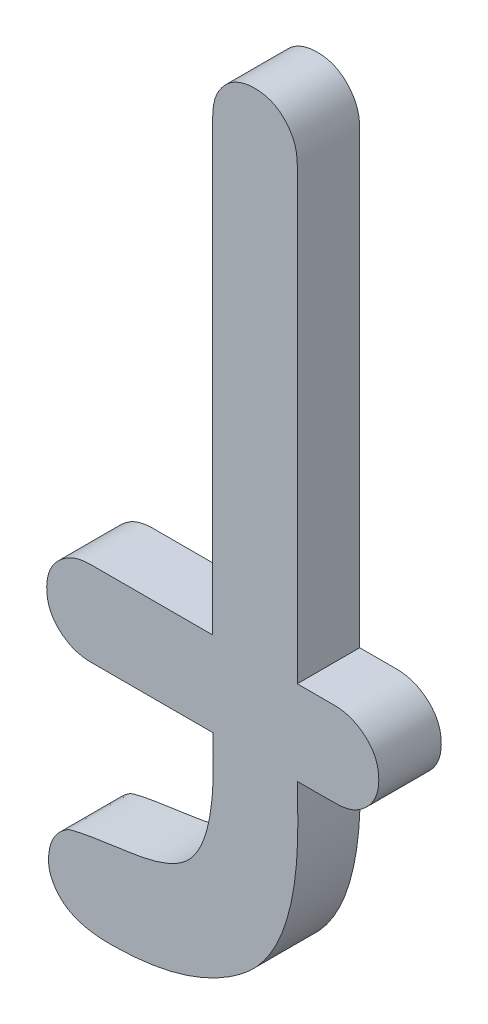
ISO-10303-21;
HEADER;
FILE_DESCRIPTION(('STEP AP214'),'2;1');
FILE_NAME('part.step','',(''),(''),'','','');
FILE_SCHEMA(('AUTOMOTIVE_DESIGN { 1 0 10303 214 1 1 1 1 }'));
ENDSEC;
DATA;
#1=APPLICATION_CONTEXT('core data for automotive mechanical design processes');
#2=APPLICATION_PROTOCOL_DEFINITION('international standard','automotive_design',2000,#1);
#3=PRODUCT_CONTEXT('',#1,'mechanical');
#4=PRODUCT('Part','Part','',(#3));
#5=PRODUCT_RELATED_PRODUCT_CATEGORY('part','',(#4));
#6=PRODUCT_DEFINITION_FORMATION('','',#4);
#7=PRODUCT_DEFINITION_CONTEXT('part definition',#1,'design');
#8=PRODUCT_DEFINITION('design','',#6,#7);
#9=PRODUCT_DEFINITION_SHAPE('','',#8);
#10=(LENGTH_UNIT() NAMED_UNIT(*) SI_UNIT(.MILLI.,.METRE.));
#11=(NAMED_UNIT(*) PLANE_ANGLE_UNIT() SI_UNIT($,.RADIAN.));
#12=(NAMED_UNIT(*) SI_UNIT($,.STERADIAN.) SOLID_ANGLE_UNIT());
#13=UNCERTAINTY_MEASURE_WITH_UNIT(LENGTH_MEASURE(1.E-05),#10,'distance_accuracy_value','');
#14=(GEOMETRIC_REPRESENTATION_CONTEXT(3) GLOBAL_UNCERTAINTY_ASSIGNED_CONTEXT((#13)) GLOBAL_UNIT_ASSIGNED_CONTEXT((#10,
#11,#12)) REPRESENTATION_CONTEXT('',''));
#15=CARTESIAN_POINT('',(0.,0.,0.));
#16=DIRECTION('',(0.,0.,1.));
#17=DIRECTION('',(1.,0.,0.));
#18=AXIS2_PLACEMENT_3D('',#15,#16,#17);
#19=CARTESIAN_POINT('',(36.3258798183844,-0.0550507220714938,0.500000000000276));
#20=CARTESIAN_POINT('',(36.4711179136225,-0.0550507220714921,0.500000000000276));
#21=CARTESIAN_POINT('',(36.6163560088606,-0.0550507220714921,0.500000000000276));
#22=CARTESIAN_POINT('',(36.7258798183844,-0.0550507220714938,0.500000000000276));
#23=CARTESIAN_POINT('',(36.8069496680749,-0.102468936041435,0.500000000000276));
#24=CARTESIAN_POINT('',(36.9782607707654,-0.202669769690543,0.500000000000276));
#25=CARTESIAN_POINT('',(36.9782607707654,-0.393145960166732,0.500000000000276));
#26=CARTESIAN_POINT('',(36.9782607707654,-0.583622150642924,0.500000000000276));
#27=CARTESIAN_POINT('',(36.8065835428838,-0.687974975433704,0.500000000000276));
#28=CARTESIAN_POINT('',(36.7354036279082,-0.731241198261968,0.500000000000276));
#29=CARTESIAN_POINT('',(36.6163560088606,-0.731241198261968,0.500000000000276));
#30=CARTESIAN_POINT('',(36.4711179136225,-0.731241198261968,0.500000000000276));
#31=CARTESIAN_POINT('',(36.3258798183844,-0.731241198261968,0.500000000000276));
#32=B_SPLINE_CURVE_WITH_KNOTS('',2,(#19,#20,#21,#22,#23,#24,#25,#26,#27,#28,#29,#30,#31),
.UNSPECIFIED.,.F.,.F.,(3,2,2,2,2,2,3),(0.,1.,2.,3.,4.,5.,6.),.UNSPECIFIED.);
#33=DIRECTION('',(0.,0.,-1.));
#34=VECTOR('',#33,1.);
#35=SURFACE_OF_LINEAR_EXTRUSION('',#32,#34);
#36=CARTESIAN_POINT('',(36.3258798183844,-0.0550507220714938,2.76221729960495E-13));
#37=CARTESIAN_POINT('',(36.4711179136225,-0.0550507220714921,2.7623951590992E-13));
#38=CARTESIAN_POINT('',(36.6163560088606,-0.0550507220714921,2.76257301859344E-13));
#39=CARTESIAN_POINT('',(36.7258798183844,-0.0550507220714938,2.76270714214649E-13));
#40=CARTESIAN_POINT('',(36.8069496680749,-0.102468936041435,2.76280642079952E-13));
#41=CARTESIAN_POINT('',(36.9782607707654,-0.202669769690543,2.76301620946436E-13));
#42=CARTESIAN_POINT('',(36.9782607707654,-0.393145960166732,2.76301620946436E-13));
#43=CARTESIAN_POINT('',(36.9782607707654,-0.583622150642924,2.76301620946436E-13));
#44=CARTESIAN_POINT('',(36.8065835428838,-0.687974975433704,2.76280597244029E-13));
#45=CARTESIAN_POINT('',(36.7354036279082,-0.731241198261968,2.76271880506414E-13));
#46=CARTESIAN_POINT('',(36.6163560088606,-0.731241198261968,2.76257301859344E-13));
#47=CARTESIAN_POINT('',(36.4711179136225,-0.731241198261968,2.7623951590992E-13));
#48=CARTESIAN_POINT('',(36.3258798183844,-0.731241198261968,2.76221729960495E-13));
#49=B_SPLINE_CURVE_WITH_KNOTS('',2,(#36,#37,#38,#39,#40,#41,#42,#43,#44,#45,#46,#47,#48),
.UNSPECIFIED.,.F.,.F.,(3,2,2,2,2,2,3),(0.,1.,2.,3.,4.,5.,6.),.UNSPECIFIED.);
#50=CARTESIAN_POINT('',(36.3258798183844,-0.0550507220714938,2.76221729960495E-13));
#51=VERTEX_POINT('',#50);
#52=CARTESIAN_POINT('',(36.3258798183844,-0.731241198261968,2.76221729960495E-13));
#53=VERTEX_POINT('',#52);
#54=EDGE_CURVE('E57',#51,#53,#49,.T.);
#55=ORIENTED_EDGE('',*,*,#54,.F.);
#56=DIRECTION('',(0.,0.,-1.));
#57=VECTOR('',#56,1.);
#58=CARTESIAN_POINT('',(36.3258798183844,-0.0550507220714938,0.500000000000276));
#59=LINE('',#58,#57);
#60=CARTESIAN_POINT('',(36.3258798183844,-0.0550507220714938,0.500000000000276));
#61=VERTEX_POINT('',#60);
#62=EDGE_CURVE('E32',#61,#51,#59,.T.);
#63=ORIENTED_EDGE('',*,*,#62,.F.);
#64=CARTESIAN_POINT('',(36.3258798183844,-0.731241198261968,0.500000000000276));
#65=VERTEX_POINT('',#64);
#66=EDGE_CURVE('E59',#61,#65,#32,.T.);
#67=ORIENTED_EDGE('',*,*,#66,.T.);
#68=DIRECTION('',(0.,0.,-1.));
#69=VECTOR('',#68,1.);
#70=CARTESIAN_POINT('',(36.3258798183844,-0.731241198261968,0.500000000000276));
#71=LINE('',#70,#69);
#72=EDGE_CURVE('E11',#65,#53,#71,.T.);
#73=ORIENTED_EDGE('',*,*,#72,.T.);
#74=EDGE_LOOP('',(#55,#63,#67,#73));
#75=FACE_BOUND('',#74,.T.);
#76=ADVANCED_FACE('F16',(#75),#35,.T.);
#77=CARTESIAN_POINT('',(36.3258798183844,-0.731241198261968,0.500000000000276));
#78=CARTESIAN_POINT('',(36.3306417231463,-0.936003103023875,0.500000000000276));
#79=CARTESIAN_POINT('',(36.3306417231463,-1.03124119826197,0.500000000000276));
#80=CARTESIAN_POINT('',(36.3306417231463,-1.92647929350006,0.500000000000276));
#81=CARTESIAN_POINT('',(35.9027756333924,-2.27021441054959,0.500000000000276));
#82=CARTESIAN_POINT('',(35.4830226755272,-2.60743167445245,0.500000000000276));
#83=CARTESIAN_POINT('',(34.8258798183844,-2.60743167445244,0.500000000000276));
#84=CARTESIAN_POINT('',(34.5354036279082,-2.60743167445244,0.500000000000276));
#85=CARTESIAN_POINT('',(34.417704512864,-2.47291840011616,0.500000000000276));
#86=CARTESIAN_POINT('',(34.3354036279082,-2.37886024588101,0.500000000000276));
#87=CARTESIAN_POINT('',(34.3354036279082,-2.27409834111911,0.500000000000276));
#88=CARTESIAN_POINT('',(34.3354036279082,-2.07886024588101,0.500000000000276));
#89=CARTESIAN_POINT('',(34.4860593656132,-1.98559717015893,0.500000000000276));
#90=CARTESIAN_POINT('',(34.5354036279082,-1.95505072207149,0.500000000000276));
#91=CARTESIAN_POINT('',(34.9877964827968,-1.89323306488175,0.500000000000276));
#92=CARTESIAN_POINT('',(35.3020702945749,-1.85028881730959,0.500000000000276));
#93=CARTESIAN_POINT('',(35.4395572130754,-1.72580741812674,0.500000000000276));
#94=CARTESIAN_POINT('',(35.6544512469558,-1.53124119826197,0.500000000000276));
#95=CARTESIAN_POINT('',(35.6544512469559,-0.9598126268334,0.500000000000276));
#96=CARTESIAN_POINT('',(35.6544512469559,-0.893145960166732,0.500000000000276));
#97=CARTESIAN_POINT('',(35.649689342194,-0.73124119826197,0.500000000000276));
#98=B_SPLINE_CURVE_WITH_KNOTS('',2,(#77,#78,#79,#80,#81,#82,#83,#84,#85,#86,#87,#88,#89,#90,#91,
#92,#93,#94,#95,#96,#97),.UNSPECIFIED.,.F.,.F.,(3,2,2,2,2,2,2,2,2,2,3),(6.,7.,8.,9.,10.,11.,12.,
13.,14.,15.,16.),.UNSPECIFIED.);
#99=DIRECTION('',(0.,0.,-1.));
#100=VECTOR('',#99,1.);
#101=SURFACE_OF_LINEAR_EXTRUSION('',#98,#100);
#102=CARTESIAN_POINT('',(36.3258798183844,-0.731241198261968,2.76221729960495E-13));
#103=CARTESIAN_POINT('',(36.3306417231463,-0.936003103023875,2.76222313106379E-13));
#104=CARTESIAN_POINT('',(36.3306417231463,-1.03124119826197,2.76222313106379E-13));
#105=CARTESIAN_POINT('',(36.3306417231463,-1.92647929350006,2.76222313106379E-13));
#106=CARTESIAN_POINT('',(35.9027756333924,-2.27021441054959,2.76169916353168E-13));
#107=CARTESIAN_POINT('',(35.4830226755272,-2.60743167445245,2.76118513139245E-13));
#108=CARTESIAN_POINT('',(34.8258798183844,-2.60743167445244,2.76038039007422E-13));
#109=CARTESIAN_POINT('',(34.5354036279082,-2.60743167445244,2.76002467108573E-13));
#110=CARTESIAN_POINT('',(34.417704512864,-2.47291840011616,2.75988053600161E-13));
#111=CARTESIAN_POINT('',(34.3354036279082,-2.37886024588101,2.75977974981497E-13));
#112=CARTESIAN_POINT('',(34.3354036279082,-2.27409834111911,2.75977974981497E-13));
#113=CARTESIAN_POINT('',(34.3354036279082,-2.07886024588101,2.75977974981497E-13));
#114=CARTESIAN_POINT('',(34.4860593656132,-1.98559717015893,2.7599642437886E-13));
#115=CARTESIAN_POINT('',(34.5354036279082,-1.95505072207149,2.76002467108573E-13));
#116=CARTESIAN_POINT('',(34.9877964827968,-1.89323306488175,2.76057867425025E-13));
#117=CARTESIAN_POINT('',(35.3020702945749,-1.85028881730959,2.760963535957E-13));
#118=CARTESIAN_POINT('',(35.4395572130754,-1.72580741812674,2.76113190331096E-13));
#119=CARTESIAN_POINT('',(35.6544512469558,-1.53124119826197,2.76139506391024E-13));
#120=CARTESIAN_POINT('',(35.6544512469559,-0.9598126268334,2.76139506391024E-13));
#121=CARTESIAN_POINT('',(35.6544512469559,-0.893145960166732,2.76139506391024E-13));
#122=CARTESIAN_POINT('',(35.649689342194,-0.73124119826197,2.76138923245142E-13));
#123=B_SPLINE_CURVE_WITH_KNOTS('',2,(#102,#103,#104,#105,#106,#107,#108,#109,#110,#111,#112,
#113,#114,#115,#116,#117,#118,#119,#120,#121,#122),.UNSPECIFIED.,.F.,.F.,(3,2,2,2,2,2,2,2,2,2,
3),(6.,7.,8.,9.,10.,11.,12.,13.,14.,15.,16.),.UNSPECIFIED.);
#124=CARTESIAN_POINT('',(35.649689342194,-0.73124119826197,2.76138923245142E-13));
#125=VERTEX_POINT('',#124);
#126=EDGE_CURVE('E64',#53,#125,#123,.T.);
#127=ORIENTED_EDGE('',*,*,#126,.F.);
#128=ORIENTED_EDGE('',*,*,#72,.F.);
#129=CARTESIAN_POINT('',(35.649689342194,-0.73124119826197,0.500000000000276));
#130=VERTEX_POINT('',#129);
#131=EDGE_CURVE('E114',#65,#130,#98,.T.);
#132=ORIENTED_EDGE('',*,*,#131,.T.);
#133=DIRECTION('',(0.,0.,-1.));
#134=VECTOR('',#133,1.);
#135=CARTESIAN_POINT('',(35.649689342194,-0.73124119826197,0.500000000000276));
#136=LINE('',#135,#134);
#137=EDGE_CURVE('E25',#130,#125,#136,.T.);
#138=ORIENTED_EDGE('',*,*,#137,.T.);
#139=EDGE_LOOP('',(#127,#128,#132,#138));
#140=FACE_BOUND('',#139,.T.);
#141=ADVANCED_FACE('F65',(#140),#101,.T.);
#142=CARTESIAN_POINT('',(35.649689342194,-0.73124119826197,0.500000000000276));
#143=CARTESIAN_POINT('',(35.1639750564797,-0.73124119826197,0.500000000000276));
#144=CARTESIAN_POINT('',(34.6782607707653,-0.731241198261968,0.500000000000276));
#145=CARTESIAN_POINT('',(34.5687369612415,-0.731241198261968,0.500000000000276));
#146=CARTESIAN_POINT('',(34.4880665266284,-0.683149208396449,0.500000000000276));
#147=CARTESIAN_POINT('',(34.3211179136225,-0.583622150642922,0.500000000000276));
#148=CARTESIAN_POINT('',(34.3211179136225,-0.393145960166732,0.500000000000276));
#149=CARTESIAN_POINT('',(34.3211179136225,-0.202669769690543,0.500000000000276));
#150=CARTESIAN_POINT('',(34.4872043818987,-0.101715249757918,0.500000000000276));
#151=CARTESIAN_POINT('',(34.5639750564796,-0.0550507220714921,0.500000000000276));
#152=CARTESIAN_POINT('',(34.6782607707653,-0.0550507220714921,0.500000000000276));
#153=CARTESIAN_POINT('',(35.1639750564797,-0.0550507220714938,0.500000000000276));
#154=CARTESIAN_POINT('',(35.649689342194,-0.0550507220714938,0.500000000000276));
#155=B_SPLINE_CURVE_WITH_KNOTS('',2,(#142,#143,#144,#145,#146,#147,#148,#149,#150,#151,#152,
#153,#154),.UNSPECIFIED.,.F.,.F.,(3,2,2,2,2,2,3),(16.,17.,18.,19.,20.,21.,22.),.UNSPECIFIED.);
#156=DIRECTION('',(0.,0.,-1.));
#157=VECTOR('',#156,1.);
#158=SURFACE_OF_LINEAR_EXTRUSION('',#155,#157);
#159=CARTESIAN_POINT('',(35.649689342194,-0.73124119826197,2.76138923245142E-13));
#160=CARTESIAN_POINT('',(35.1639750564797,-0.73124119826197,2.76079442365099E-13));
#161=CARTESIAN_POINT('',(34.6782607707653,-0.731241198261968,2.76019961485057E-13));
#162=CARTESIAN_POINT('',(34.5687369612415,-0.731241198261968,2.76006549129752E-13));
#163=CARTESIAN_POINT('',(34.4880665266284,-0.683149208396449,2.75996670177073E-13));
#164=CARTESIAN_POINT('',(34.3211179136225,-0.583622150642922,2.75976225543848E-13));
#165=CARTESIAN_POINT('',(34.3211179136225,-0.393145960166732,2.75976225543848E-13));
#166=CARTESIAN_POINT('',(34.3211179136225,-0.202669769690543,2.75976225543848E-13));
#167=CARTESIAN_POINT('',(34.4872043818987,-0.101715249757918,2.75996564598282E-13));
#168=CARTESIAN_POINT('',(34.5639750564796,-0.0550507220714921,2.7600596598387E-13));
#169=CARTESIAN_POINT('',(34.6782607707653,-0.0550507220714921,2.76019961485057E-13));
#170=CARTESIAN_POINT('',(35.1639750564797,-0.0550507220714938,2.76079442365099E-13));
#171=CARTESIAN_POINT('',(35.649689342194,-0.0550507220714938,2.76138923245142E-13));
#172=B_SPLINE_CURVE_WITH_KNOTS('',2,(#159,#160,#161,#162,#163,#164,#165,#166,#167,#168,#169,
#170,#171),.UNSPECIFIED.,.F.,.F.,(3,2,2,2,2,2,3),(16.,17.,18.,19.,20.,21.,22.),.UNSPECIFIED.);
#173=CARTESIAN_POINT('',(35.649689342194,-0.0550507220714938,2.76138923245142E-13));
#174=VERTEX_POINT('',#173);
#175=EDGE_CURVE('E70',#125,#174,#172,.T.);
#176=ORIENTED_EDGE('',*,*,#175,.F.);
#177=ORIENTED_EDGE('',*,*,#137,.F.);
#178=CARTESIAN_POINT('',(35.649689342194,-0.0550507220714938,0.500000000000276));
#179=VERTEX_POINT('',#178);
#180=EDGE_CURVE('E123',#130,#179,#155,.T.);
#181=ORIENTED_EDGE('',*,*,#180,.T.);
#182=DIRECTION('',(0.,0.,-1.));
#183=VECTOR('',#182,1.);
#184=CARTESIAN_POINT('',(35.649689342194,-0.0550507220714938,0.500000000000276));
#185=LINE('',#184,#183);
#186=EDGE_CURVE('E39',#179,#174,#185,.T.);
#187=ORIENTED_EDGE('',*,*,#186,.T.);
#188=EDGE_LOOP('',(#176,#177,#181,#187));
#189=FACE_BOUND('',#188,.T.);
#190=ADVANCED_FACE('F133',(#189),#158,.T.);
#191=CARTESIAN_POINT('',(35.649689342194,-0.0550507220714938,0.500000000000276));
#192=CARTESIAN_POINT('',(35.649689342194,1.74256832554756,0.500000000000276));
#193=CARTESIAN_POINT('',(35.649689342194,3.5401873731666,0.500000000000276));
#194=CARTESIAN_POINT('',(35.649689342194,3.65447308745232,0.500000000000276));
#195=CARTESIAN_POINT('',(35.694560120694,3.73224910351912,0.500000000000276));
#196=CARTESIAN_POINT('',(35.792546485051,3.90209213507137,0.500000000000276));
#197=CARTESIAN_POINT('',(35.9877845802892,3.90209213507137,0.500000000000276));
#198=CARTESIAN_POINT('',(36.1782607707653,3.90209213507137,0.500000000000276));
#199=CARTESIAN_POINT('',(36.279882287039,3.73163023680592,0.500000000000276));
#200=CARTESIAN_POINT('',(36.3258798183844,3.65447308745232,0.500000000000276));
#201=CARTESIAN_POINT('',(36.3258798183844,3.5401873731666,0.500000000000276));
#202=CARTESIAN_POINT('',(36.3258798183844,1.74256832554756,0.500000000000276));
#203=CARTESIAN_POINT('',(36.3258798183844,-0.0550507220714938,0.500000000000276));
#204=B_SPLINE_CURVE_WITH_KNOTS('',2,(#191,#192,#193,#194,#195,#196,#197,#198,#199,#200,#201,
#202,#203),.UNSPECIFIED.,.F.,.F.,(3,2,2,2,2,2,3),(22.,23.,24.,25.,26.,27.,28.),.UNSPECIFIED.);
#205=DIRECTION('',(0.,0.,-1.));
#206=VECTOR('',#205,1.);
#207=SURFACE_OF_LINEAR_EXTRUSION('',#204,#206);
#208=CARTESIAN_POINT('',(35.649689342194,-0.0550507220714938,2.76138923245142E-13));
#209=CARTESIAN_POINT('',(35.649689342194,1.74256832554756,2.76138923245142E-13));
#210=CARTESIAN_POINT('',(35.649689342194,3.5401873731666,2.76138923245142E-13));
#211=CARTESIAN_POINT('',(35.649689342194,3.65447308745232,2.76138923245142E-13));
#212=CARTESIAN_POINT('',(35.694560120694,3.73224910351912,2.76144418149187E-13));
#213=CARTESIAN_POINT('',(35.792546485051,3.90209213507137,2.76156417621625E-13));
#214=CARTESIAN_POINT('',(35.9877845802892,3.90209213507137,2.76180326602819E-13));
#215=CARTESIAN_POINT('',(36.1782607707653,3.90209213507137,2.7620365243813E-13));
#216=CARTESIAN_POINT('',(36.279882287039,3.73163023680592,2.76216097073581E-13));
#217=CARTESIAN_POINT('',(36.3258798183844,3.65447308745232,2.76221729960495E-13));
#218=CARTESIAN_POINT('',(36.3258798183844,3.5401873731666,2.76221729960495E-13));
#219=CARTESIAN_POINT('',(36.3258798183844,1.74256832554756,2.76221729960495E-13));
#220=CARTESIAN_POINT('',(36.3258798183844,-0.0550507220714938,2.76221729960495E-13));
#221=B_SPLINE_CURVE_WITH_KNOTS('',2,(#208,#209,#210,#211,#212,#213,#214,#215,#216,#217,#218,
#219,#220),.UNSPECIFIED.,.F.,.F.,(3,2,2,2,2,2,3),(22.,23.,24.,25.,26.,27.,28.),.UNSPECIFIED.);
#222=EDGE_CURVE('E74',#174,#51,#221,.T.);
#223=ORIENTED_EDGE('',*,*,#222,.F.);
#224=ORIENTED_EDGE('',*,*,#186,.F.);
#225=EDGE_CURVE('E142',#179,#61,#204,.T.);
#226=ORIENTED_EDGE('',*,*,#225,.T.);
#227=ORIENTED_EDGE('',*,*,#62,.T.);
#228=EDGE_LOOP('',(#223,#224,#226,#227));
#229=FACE_BOUND('',#228,.T.);
#230=ADVANCED_FACE('F136',(#229),#207,.T.);
#231=CARTESIAN_POINT('',(36.9782607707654,-0.393145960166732,0.500000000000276));
#232=DIRECTION('',(0.,0.,1.));
#233=DIRECTION('',(-0.318247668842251,-0.948007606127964,0.));
#234=AXIS2_PLACEMENT_3D('',#231,#232,#233);
#235=PLANE('',#234);
#236=ORIENTED_EDGE('',*,*,#66,.F.);
#237=ORIENTED_EDGE('',*,*,#225,.F.);
#238=ORIENTED_EDGE('',*,*,#180,.F.);
#239=ORIENTED_EDGE('',*,*,#131,.F.);
#240=EDGE_LOOP('',(#236,#237,#238,#239));
#241=FACE_BOUND('',#240,.T.);
#242=ADVANCED_FACE('F140',(#241),#235,.T.);
#243=CARTESIAN_POINT('',(36.9782607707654,-0.393145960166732,2.76301620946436E-13));
#244=DIRECTION('',(0.,0.,1.));
#245=DIRECTION('',(-0.318247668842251,-0.948007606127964,0.));
#246=AXIS2_PLACEMENT_3D('',#243,#244,#245);
#247=PLANE('',#246);
#248=ORIENTED_EDGE('',*,*,#54,.T.);
#249=ORIENTED_EDGE('',*,*,#126,.T.);
#250=ORIENTED_EDGE('',*,*,#175,.T.);
#251=ORIENTED_EDGE('',*,*,#222,.T.);
#252=EDGE_LOOP('',(#248,#249,#250,#251));
#253=FACE_BOUND('',#252,.T.);
#254=ADVANCED_FACE('F73',(#253),#247,.F.);
#255=CLOSED_SHELL('',(#76,#141,#190,#230,#242,#254));
#256=MANIFOLD_SOLID_BREP('B1',#255);
#257=ADVANCED_BREP_SHAPE_REPRESENTATION('',(#18,#256),#14);
#258=SHAPE_DEFINITION_REPRESENTATION(#9,#257);
ENDSEC;
END-ISO-10303-21;
